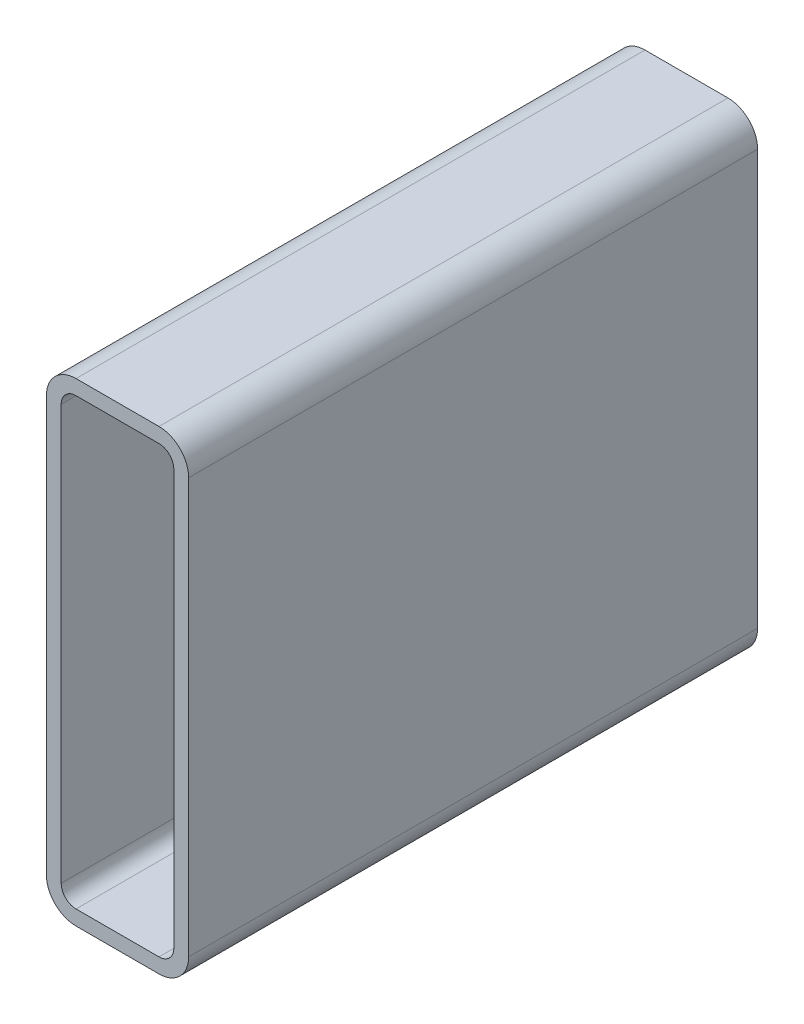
ISO-10303-21;
HEADER;
FILE_DESCRIPTION(('STEP AP214'),'2;1');
FILE_NAME('part.step','',(''),(''),'','','');
FILE_SCHEMA(('AUTOMOTIVE_DESIGN { 1 0 10303 214 1 1 1 1 }'));
ENDSEC;
DATA;
#1=APPLICATION_CONTEXT('core data for automotive mechanical design processes');
#2=APPLICATION_PROTOCOL_DEFINITION('international standard','automotive_design',2000,#1);
#3=PRODUCT_CONTEXT('',#1,'mechanical');
#4=PRODUCT('Part','Part','',(#3));
#5=PRODUCT_RELATED_PRODUCT_CATEGORY('part','',(#4));
#6=PRODUCT_DEFINITION_FORMATION('','',#4);
#7=PRODUCT_DEFINITION_CONTEXT('part definition',#1,'design');
#8=PRODUCT_DEFINITION('design','',#6,#7);
#9=PRODUCT_DEFINITION_SHAPE('','',#8);
#10=(LENGTH_UNIT() NAMED_UNIT(*) SI_UNIT(.MILLI.,.METRE.));
#11=(NAMED_UNIT(*) PLANE_ANGLE_UNIT() SI_UNIT($,.RADIAN.));
#12=(NAMED_UNIT(*) SI_UNIT($,.STERADIAN.) SOLID_ANGLE_UNIT());
#13=UNCERTAINTY_MEASURE_WITH_UNIT(LENGTH_MEASURE(1.E-05),#10,'distance_accuracy_value','');
#14=(GEOMETRIC_REPRESENTATION_CONTEXT(3) GLOBAL_UNCERTAINTY_ASSIGNED_CONTEXT((#13)) GLOBAL_UNIT_ASSIGNED_CONTEXT((#10,
#11,#12)) REPRESENTATION_CONTEXT('',''));
#15=CARTESIAN_POINT('',(0.,0.,0.));
#16=DIRECTION('',(0.,0.,1.));
#17=DIRECTION('',(1.,0.,0.));
#18=AXIS2_PLACEMENT_3D('',#15,#16,#17);
#19=CARTESIAN_POINT('',(18.3641160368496,240.045313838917,304.8));
#20=DIRECTION('',(0.,0.,1.));
#21=DIRECTION('',(1.,0.,0.));
#22=AXIS2_PLACEMENT_3D('',#19,#20,#21);
#23=PLANE('',#22);
#24=CARTESIAN_POINT('',(18.3641160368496,240.045313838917,304.8));
#25=DIRECTION('',(0.,0.,1.));
#26=DIRECTION('',(1.,0.,0.));
#27=AXIS2_PLACEMENT_3D('',#24,#25,#26);
#28=CIRCLE('',#27,15.875);
#29=CARTESIAN_POINT('',(18.3641160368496,255.920313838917,304.8));
#30=VERTEX_POINT('',#29);
#31=CARTESIAN_POINT('',(2.48911603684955,240.045313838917,304.8));
#32=VERTEX_POINT('',#31);
#33=EDGE_CURVE('E211',#30,#32,#28,.T.);
#34=ORIENTED_EDGE('',*,*,#33,.T.);
#35=DIRECTION('',(0.,-1.,0.));
#36=VECTOR('',#35,1.);
#37=CARTESIAN_POINT('',(2.48911603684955,17.7953138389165,304.8));
#38=LINE('',#37,#36);
#39=CARTESIAN_POINT('',(2.48911603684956,17.7953138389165,304.8));
#40=VERTEX_POINT('',#39);
#41=EDGE_CURVE('E214',#32,#40,#38,.T.);
#42=ORIENTED_EDGE('',*,*,#41,.T.);
#43=CARTESIAN_POINT('',(18.3641160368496,17.7953138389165,304.8));
#44=DIRECTION('',(0.,0.,1.));
#45=DIRECTION('',(1.,0.,0.));
#46=AXIS2_PLACEMENT_3D('',#43,#44,#45);
#47=CIRCLE('',#46,15.875);
#48=CARTESIAN_POINT('',(18.3641160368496,1.92031383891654,304.8));
#49=VERTEX_POINT('',#48);
#50=EDGE_CURVE('E217',#40,#49,#47,.T.);
#51=ORIENTED_EDGE('',*,*,#50,.T.);
#52=DIRECTION('',(1.,0.,0.));
#53=VECTOR('',#52,1.);
#54=CARTESIAN_POINT('',(62.8141160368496,1.92031383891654,304.8));
#55=LINE('',#54,#53);
#56=CARTESIAN_POINT('',(62.8141160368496,1.92031383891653,304.8));
#57=VERTEX_POINT('',#56);
#58=EDGE_CURVE('E219',#49,#57,#55,.T.);
#59=ORIENTED_EDGE('',*,*,#58,.T.);
#60=CARTESIAN_POINT('',(62.8141160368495,17.7953138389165,304.8));
#61=DIRECTION('',(0.,0.,1.));
#62=DIRECTION('',(1.,0.,0.));
#63=AXIS2_PLACEMENT_3D('',#60,#61,#62);
#64=CIRCLE('',#63,15.875);
#65=CARTESIAN_POINT('',(78.6891160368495,17.7953138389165,304.8));
#66=VERTEX_POINT('',#65);
#67=EDGE_CURVE('E221',#57,#66,#64,.T.);
#68=ORIENTED_EDGE('',*,*,#67,.T.);
#69=DIRECTION('',(0.,1.,0.));
#70=VECTOR('',#69,1.);
#71=CARTESIAN_POINT('',(78.6891160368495,240.045313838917,304.8));
#72=LINE('',#71,#70);
#73=CARTESIAN_POINT('',(78.6891160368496,240.045313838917,304.8));
#74=VERTEX_POINT('',#73);
#75=EDGE_CURVE('E223',#66,#74,#72,.T.);
#76=ORIENTED_EDGE('',*,*,#75,.T.);
#77=CARTESIAN_POINT('',(62.8141160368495,240.045313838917,304.8));
#78=DIRECTION('',(0.,0.,1.));
#79=DIRECTION('',(1.,0.,0.));
#80=AXIS2_PLACEMENT_3D('',#77,#78,#79);
#81=CIRCLE('',#80,15.875);
#82=CARTESIAN_POINT('',(62.8141160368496,255.920313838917,304.8));
#83=VERTEX_POINT('',#82);
#84=EDGE_CURVE('E225',#74,#83,#81,.T.);
#85=ORIENTED_EDGE('',*,*,#84,.T.);
#86=DIRECTION('',(-1.,0.,0.));
#87=VECTOR('',#86,1.);
#88=CARTESIAN_POINT('',(18.3641160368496,255.920313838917,304.8));
#89=LINE('',#88,#87);
#90=EDGE_CURVE('E227',#83,#30,#89,.T.);
#91=ORIENTED_EDGE('',*,*,#90,.T.);
#92=EDGE_LOOP('',(#34,#42,#51,#59,#68,#76,#85,#91));
#93=FACE_BOUND('',#92,.T.);
#94=DIRECTION('',(0.,-1.,0.));
#95=VECTOR('',#94,1.);
#96=CARTESIAN_POINT('',(10.4266160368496,17.7953138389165,304.8));
#97=LINE('',#96,#95);
#98=CARTESIAN_POINT('',(10.4266160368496,240.045313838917,304.8));
#99=VERTEX_POINT('',#98);
#100=CARTESIAN_POINT('',(10.4266160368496,17.7953138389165,304.8));
#101=VERTEX_POINT('',#100);
#102=EDGE_CURVE('E154',#99,#101,#97,.T.);
#103=ORIENTED_EDGE('',*,*,#102,.F.);
#104=CARTESIAN_POINT('',(18.3641160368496,240.045313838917,304.8));
#105=DIRECTION('',(0.,0.,1.));
#106=DIRECTION('',(1.,0.,0.));
#107=AXIS2_PLACEMENT_3D('',#104,#105,#106);
#108=CIRCLE('',#107,7.9375);
#109=CARTESIAN_POINT('',(18.3641160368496,247.982813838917,304.8));
#110=VERTEX_POINT('',#109);
#111=EDGE_CURVE('E146',#110,#99,#108,.T.);
#112=ORIENTED_EDGE('',*,*,#111,.F.);
#113=DIRECTION('',(-1.,0.,0.));
#114=VECTOR('',#113,1.);
#115=CARTESIAN_POINT('',(18.3641160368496,247.982813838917,304.8));
#116=LINE('',#115,#114);
#117=CARTESIAN_POINT('',(62.8141160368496,247.982813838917,304.8));
#118=VERTEX_POINT('',#117);
#119=EDGE_CURVE('E179',#118,#110,#116,.T.);
#120=ORIENTED_EDGE('',*,*,#119,.F.);
#121=CARTESIAN_POINT('',(62.8141160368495,240.045313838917,304.8));
#122=DIRECTION('',(0.,0.,1.));
#123=DIRECTION('',(1.,0.,0.));
#124=AXIS2_PLACEMENT_3D('',#121,#122,#123);
#125=CIRCLE('',#124,7.9375);
#126=CARTESIAN_POINT('',(70.7516160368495,240.045313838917,304.8));
#127=VERTEX_POINT('',#126);
#128=EDGE_CURVE('E177',#127,#118,#125,.T.);
#129=ORIENTED_EDGE('',*,*,#128,.F.);
#130=DIRECTION('',(0.,1.,0.));
#131=VECTOR('',#130,1.);
#132=CARTESIAN_POINT('',(70.7516160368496,240.045313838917,304.8));
#133=LINE('',#132,#131);
#134=CARTESIAN_POINT('',(70.7516160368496,17.7953138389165,304.8));
#135=VERTEX_POINT('',#134);
#136=EDGE_CURVE('E175',#135,#127,#133,.T.);
#137=ORIENTED_EDGE('',*,*,#136,.F.);
#138=CARTESIAN_POINT('',(62.8141160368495,17.7953138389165,304.8));
#139=DIRECTION('',(0.,0.,1.));
#140=DIRECTION('',(1.,0.,0.));
#141=AXIS2_PLACEMENT_3D('',#138,#139,#140);
#142=CIRCLE('',#141,7.93750000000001);
#143=CARTESIAN_POINT('',(62.8141160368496,9.85781383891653,304.8));
#144=VERTEX_POINT('',#143);
#145=EDGE_CURVE('E173',#144,#135,#142,.T.);
#146=ORIENTED_EDGE('',*,*,#145,.F.);
#147=DIRECTION('',(1.,0.,0.));
#148=VECTOR('',#147,1.);
#149=CARTESIAN_POINT('',(62.8141160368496,9.85781383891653,304.8));
#150=LINE('',#149,#148);
#151=CARTESIAN_POINT('',(18.3641160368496,9.85781383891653,304.8));
#152=VERTEX_POINT('',#151);
#153=EDGE_CURVE('E169',#152,#144,#150,.T.);
#154=ORIENTED_EDGE('',*,*,#153,.F.);
#155=CARTESIAN_POINT('',(18.3641160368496,17.7953138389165,304.8));
#156=DIRECTION('',(0.,0.,1.));
#157=DIRECTION('',(1.,0.,0.));
#158=AXIS2_PLACEMENT_3D('',#155,#156,#157);
#159=CIRCLE('',#158,7.9375);
#160=EDGE_CURVE('E167',#101,#152,#159,.T.);
#161=ORIENTED_EDGE('',*,*,#160,.F.);
#162=EDGE_LOOP('',(#103,#112,#120,#129,#137,#146,#154,#161));
#163=FACE_BOUND('',#162,.T.);
#164=ADVANCED_FACE('F33',(#93,#163),#23,.T.);
#165=CARTESIAN_POINT('',(18.3641160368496,240.045313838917,0.));
#166=DIRECTION('',(0.,0.,1.));
#167=DIRECTION('',(1.,0.,0.));
#168=AXIS2_PLACEMENT_3D('',#165,#166,#167);
#169=PLANE('',#168);
#170=CARTESIAN_POINT('',(18.3641160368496,240.045313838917,0.));
#171=DIRECTION('',(0.,0.,1.));
#172=DIRECTION('',(1.,0.,0.));
#173=AXIS2_PLACEMENT_3D('',#170,#171,#172);
#174=CIRCLE('',#173,15.875);
#175=CARTESIAN_POINT('',(18.3641160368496,255.920313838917,0.));
#176=VERTEX_POINT('',#175);
#177=CARTESIAN_POINT('',(2.48911603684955,240.045313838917,0.));
#178=VERTEX_POINT('',#177);
#179=EDGE_CURVE('E162',#176,#178,#174,.T.);
#180=ORIENTED_EDGE('',*,*,#179,.F.);
#181=DIRECTION('',(-1.,0.,0.));
#182=VECTOR('',#181,1.);
#183=CARTESIAN_POINT('',(18.3641160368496,255.920313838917,0.));
#184=LINE('',#183,#182);
#185=CARTESIAN_POINT('',(62.8141160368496,255.920313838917,0.));
#186=VERTEX_POINT('',#185);
#187=EDGE_CURVE('E215',#186,#176,#184,.T.);
#188=ORIENTED_EDGE('',*,*,#187,.F.);
#189=CARTESIAN_POINT('',(62.8141160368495,240.045313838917,0.));
#190=DIRECTION('',(0.,0.,1.));
#191=DIRECTION('',(1.,0.,0.));
#192=AXIS2_PLACEMENT_3D('',#189,#190,#191);
#193=CIRCLE('',#192,15.875);
#194=CARTESIAN_POINT('',(78.6891160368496,240.045313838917,0.));
#195=VERTEX_POINT('',#194);
#196=EDGE_CURVE('E242',#195,#186,#193,.T.);
#197=ORIENTED_EDGE('',*,*,#196,.F.);
#198=DIRECTION('',(0.,1.,0.));
#199=VECTOR('',#198,1.);
#200=CARTESIAN_POINT('',(78.6891160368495,240.045313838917,0.));
#201=LINE('',#200,#199);
#202=CARTESIAN_POINT('',(78.6891160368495,17.7953138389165,0.));
#203=VERTEX_POINT('',#202);
#204=EDGE_CURVE('E240',#203,#195,#201,.T.);
#205=ORIENTED_EDGE('',*,*,#204,.F.);
#206=CARTESIAN_POINT('',(62.8141160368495,17.7953138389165,0.));
#207=DIRECTION('',(0.,0.,1.));
#208=DIRECTION('',(1.,0.,0.));
#209=AXIS2_PLACEMENT_3D('',#206,#207,#208);
#210=CIRCLE('',#209,15.875);
#211=CARTESIAN_POINT('',(62.8141160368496,1.92031383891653,0.));
#212=VERTEX_POINT('',#211);
#213=EDGE_CURVE('E238',#212,#203,#210,.T.);
#214=ORIENTED_EDGE('',*,*,#213,.F.);
#215=DIRECTION('',(1.,0.,0.));
#216=VECTOR('',#215,1.);
#217=CARTESIAN_POINT('',(62.8141160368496,1.92031383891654,0.));
#218=LINE('',#217,#216);
#219=CARTESIAN_POINT('',(18.3641160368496,1.92031383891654,0.));
#220=VERTEX_POINT('',#219);
#221=EDGE_CURVE('E236',#220,#212,#218,.T.);
#222=ORIENTED_EDGE('',*,*,#221,.F.);
#223=CARTESIAN_POINT('',(18.3641160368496,17.7953138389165,0.));
#224=DIRECTION('',(0.,0.,1.));
#225=DIRECTION('',(1.,0.,0.));
#226=AXIS2_PLACEMENT_3D('',#223,#224,#225);
#227=CIRCLE('',#226,15.875);
#228=CARTESIAN_POINT('',(2.48911603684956,17.7953138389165,0.));
#229=VERTEX_POINT('',#228);
#230=EDGE_CURVE('E234',#229,#220,#227,.T.);
#231=ORIENTED_EDGE('',*,*,#230,.F.);
#232=DIRECTION('',(0.,-1.,0.));
#233=VECTOR('',#232,1.);
#234=CARTESIAN_POINT('',(2.48911603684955,17.7953138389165,0.));
#235=LINE('',#234,#233);
#236=EDGE_CURVE('E232',#178,#229,#235,.T.);
#237=ORIENTED_EDGE('',*,*,#236,.F.);
#238=EDGE_LOOP('',(#180,#188,#197,#205,#214,#222,#231,#237));
#239=FACE_BOUND('',#238,.T.);
#240=CARTESIAN_POINT('',(18.3641160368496,240.045313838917,0.));
#241=DIRECTION('',(0.,0.,1.));
#242=DIRECTION('',(1.,0.,0.));
#243=AXIS2_PLACEMENT_3D('',#240,#241,#242);
#244=CIRCLE('',#243,7.9375);
#245=CARTESIAN_POINT('',(18.3641160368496,247.982813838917,0.));
#246=VERTEX_POINT('',#245);
#247=CARTESIAN_POINT('',(10.4266160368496,240.045313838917,0.));
#248=VERTEX_POINT('',#247);
#249=EDGE_CURVE('E56',#246,#248,#244,.T.);
#250=ORIENTED_EDGE('',*,*,#249,.T.);
#251=DIRECTION('',(0.,-1.,0.));
#252=VECTOR('',#251,1.);
#253=CARTESIAN_POINT('',(10.4266160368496,17.7953138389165,0.));
#254=LINE('',#253,#252);
#255=CARTESIAN_POINT('',(10.4266160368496,17.7953138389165,0.));
#256=VERTEX_POINT('',#255);
#257=EDGE_CURVE('E161',#248,#256,#254,.T.);
#258=ORIENTED_EDGE('',*,*,#257,.T.);
#259=CARTESIAN_POINT('',(18.3641160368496,17.7953138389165,0.));
#260=DIRECTION('',(0.,0.,1.));
#261=DIRECTION('',(1.,0.,0.));
#262=AXIS2_PLACEMENT_3D('',#259,#260,#261);
#263=CIRCLE('',#262,7.9375);
#264=CARTESIAN_POINT('',(18.3641160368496,9.85781383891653,0.));
#265=VERTEX_POINT('',#264);
#266=EDGE_CURVE('E183',#256,#265,#263,.T.);
#267=ORIENTED_EDGE('',*,*,#266,.T.);
#268=DIRECTION('',(1.,0.,0.));
#269=VECTOR('',#268,1.);
#270=CARTESIAN_POINT('',(62.8141160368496,9.85781383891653,0.));
#271=LINE('',#270,#269);
#272=CARTESIAN_POINT('',(62.8141160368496,9.85781383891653,0.));
#273=VERTEX_POINT('',#272);
#274=EDGE_CURVE('E186',#265,#273,#271,.T.);
#275=ORIENTED_EDGE('',*,*,#274,.T.);
#276=CARTESIAN_POINT('',(62.8141160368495,17.7953138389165,0.));
#277=DIRECTION('',(0.,0.,1.));
#278=DIRECTION('',(1.,0.,0.));
#279=AXIS2_PLACEMENT_3D('',#276,#277,#278);
#280=CIRCLE('',#279,7.93750000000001);
#281=CARTESIAN_POINT('',(70.7516160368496,17.7953138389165,0.));
#282=VERTEX_POINT('',#281);
#283=EDGE_CURVE('E189',#273,#282,#280,.T.);
#284=ORIENTED_EDGE('',*,*,#283,.T.);
#285=DIRECTION('',(0.,1.,0.));
#286=VECTOR('',#285,1.);
#287=CARTESIAN_POINT('',(70.7516160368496,240.045313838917,0.));
#288=LINE('',#287,#286);
#289=CARTESIAN_POINT('',(70.7516160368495,240.045313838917,0.));
#290=VERTEX_POINT('',#289);
#291=EDGE_CURVE('E192',#282,#290,#288,.T.);
#292=ORIENTED_EDGE('',*,*,#291,.T.);
#293=CARTESIAN_POINT('',(62.8141160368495,240.045313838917,0.));
#294=DIRECTION('',(0.,0.,1.));
#295=DIRECTION('',(1.,0.,0.));
#296=AXIS2_PLACEMENT_3D('',#293,#294,#295);
#297=CIRCLE('',#296,7.9375);
#298=CARTESIAN_POINT('',(62.8141160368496,247.982813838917,0.));
#299=VERTEX_POINT('',#298);
#300=EDGE_CURVE('E195',#290,#299,#297,.T.);
#301=ORIENTED_EDGE('',*,*,#300,.T.);
#302=DIRECTION('',(-1.,0.,0.));
#303=VECTOR('',#302,1.);
#304=CARTESIAN_POINT('',(18.3641160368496,247.982813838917,0.));
#305=LINE('',#304,#303);
#306=EDGE_CURVE('E155',#299,#246,#305,.T.);
#307=ORIENTED_EDGE('',*,*,#306,.T.);
#308=EDGE_LOOP('',(#250,#258,#267,#275,#284,#292,#301,#307));
#309=FACE_BOUND('',#308,.T.);
#310=ADVANCED_FACE('F272',(#239,#309),#169,.F.);
#311=CARTESIAN_POINT('',(18.3641160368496,240.045313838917,304.8));
#312=DIRECTION('',(0.,0.,-1.));
#313=DIRECTION('',(-1.,0.,0.));
#314=AXIS2_PLACEMENT_3D('',#311,#312,#313);
#315=CYLINDRICAL_SURFACE('',#314,15.875);
#316=ORIENTED_EDGE('',*,*,#179,.T.);
#317=DIRECTION('',(0.,0.,-1.));
#318=VECTOR('',#317,1.);
#319=CARTESIAN_POINT('',(2.48911603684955,240.045313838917,304.8));
#320=LINE('',#319,#318);
#321=EDGE_CURVE('E11',#32,#178,#320,.T.);
#322=ORIENTED_EDGE('',*,*,#321,.F.);
#323=ORIENTED_EDGE('',*,*,#33,.F.);
#324=DIRECTION('',(0.,0.,-1.));
#325=VECTOR('',#324,1.);
#326=CARTESIAN_POINT('',(18.3641160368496,255.920313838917,304.8));
#327=LINE('',#326,#325);
#328=EDGE_CURVE('E229',#30,#176,#327,.T.);
#329=ORIENTED_EDGE('',*,*,#328,.T.);
#330=EDGE_LOOP('',(#316,#322,#323,#329));
#331=FACE_BOUND('',#330,.T.);
#332=ADVANCED_FACE('F35',(#331),#315,.T.);
#333=CARTESIAN_POINT('',(2.48911603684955,17.7953138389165,304.8));
#334=DIRECTION('',(1.,0.,0.));
#335=DIRECTION('',(0.,0.,-1.));
#336=AXIS2_PLACEMENT_3D('',#333,#334,#335);
#337=PLANE('',#336);
#338=ORIENTED_EDGE('',*,*,#236,.T.);
#339=DIRECTION('',(0.,0.,-1.));
#340=VECTOR('',#339,1.);
#341=CARTESIAN_POINT('',(2.48911603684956,17.7953138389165,304.8));
#342=LINE('',#341,#340);
#343=EDGE_CURVE('E41',#40,#229,#342,.T.);
#344=ORIENTED_EDGE('',*,*,#343,.F.);
#345=ORIENTED_EDGE('',*,*,#41,.F.);
#346=ORIENTED_EDGE('',*,*,#321,.T.);
#347=EDGE_LOOP('',(#338,#344,#345,#346));
#348=FACE_BOUND('',#347,.T.);
#349=ADVANCED_FACE('F289',(#348),#337,.F.);
#350=CARTESIAN_POINT('',(18.3641160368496,17.7953138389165,304.8));
#351=DIRECTION('',(0.,0.,-1.));
#352=DIRECTION('',(-1.,0.,0.));
#353=AXIS2_PLACEMENT_3D('',#350,#351,#352);
#354=CYLINDRICAL_SURFACE('',#353,15.875);
#355=ORIENTED_EDGE('',*,*,#230,.T.);
#356=DIRECTION('',(0.,0.,-1.));
#357=VECTOR('',#356,1.);
#358=CARTESIAN_POINT('',(18.3641160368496,1.92031383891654,304.8));
#359=LINE('',#358,#357);
#360=EDGE_CURVE('E259',#49,#220,#359,.T.);
#361=ORIENTED_EDGE('',*,*,#360,.F.);
#362=ORIENTED_EDGE('',*,*,#50,.F.);
#363=ORIENTED_EDGE('',*,*,#343,.T.);
#364=EDGE_LOOP('',(#355,#361,#362,#363));
#365=FACE_BOUND('',#364,.T.);
#366=ADVANCED_FACE('F266',(#365),#354,.T.);
#367=CARTESIAN_POINT('',(62.8141160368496,1.92031383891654,304.8));
#368=DIRECTION('',(0.,1.,0.));
#369=DIRECTION('',(0.,0.,1.));
#370=AXIS2_PLACEMENT_3D('',#367,#368,#369);
#371=PLANE('',#370);
#372=ORIENTED_EDGE('',*,*,#221,.T.);
#373=DIRECTION('',(0.,0.,-1.));
#374=VECTOR('',#373,1.);
#375=CARTESIAN_POINT('',(62.8141160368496,1.92031383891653,304.8));
#376=LINE('',#375,#374);
#377=EDGE_CURVE('E256',#57,#212,#376,.T.);
#378=ORIENTED_EDGE('',*,*,#377,.F.);
#379=ORIENTED_EDGE('',*,*,#58,.F.);
#380=ORIENTED_EDGE('',*,*,#360,.T.);
#381=EDGE_LOOP('',(#372,#378,#379,#380));
#382=FACE_BOUND('',#381,.T.);
#383=ADVANCED_FACE('F278',(#382),#371,.F.);
#384=CARTESIAN_POINT('',(62.8141160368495,17.7953138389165,304.8));
#385=DIRECTION('',(0.,0.,-1.));
#386=DIRECTION('',(-1.,0.,0.));
#387=AXIS2_PLACEMENT_3D('',#384,#385,#386);
#388=CYLINDRICAL_SURFACE('',#387,15.875);
#389=ORIENTED_EDGE('',*,*,#213,.T.);
#390=DIRECTION('',(0.,0.,-1.));
#391=VECTOR('',#390,1.);
#392=CARTESIAN_POINT('',(78.6891160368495,17.7953138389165,304.8));
#393=LINE('',#392,#391);
#394=EDGE_CURVE('E253',#66,#203,#393,.T.);
#395=ORIENTED_EDGE('',*,*,#394,.F.);
#396=ORIENTED_EDGE('',*,*,#67,.F.);
#397=ORIENTED_EDGE('',*,*,#377,.T.);
#398=EDGE_LOOP('',(#389,#395,#396,#397));
#399=FACE_BOUND('',#398,.T.);
#400=ADVANCED_FACE('F282',(#399),#388,.T.);
#401=CARTESIAN_POINT('',(78.6891160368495,240.045313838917,304.8));
#402=DIRECTION('',(-1.,0.,0.));
#403=DIRECTION('',(0.,0.,1.));
#404=AXIS2_PLACEMENT_3D('',#401,#402,#403);
#405=PLANE('',#404);
#406=ORIENTED_EDGE('',*,*,#204,.T.);
#407=DIRECTION('',(0.,0.,-1.));
#408=VECTOR('',#407,1.);
#409=CARTESIAN_POINT('',(78.6891160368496,240.045313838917,304.8));
#410=LINE('',#409,#408);
#411=EDGE_CURVE('E250',#74,#195,#410,.T.);
#412=ORIENTED_EDGE('',*,*,#411,.F.);
#413=ORIENTED_EDGE('',*,*,#75,.F.);
#414=ORIENTED_EDGE('',*,*,#394,.T.);
#415=EDGE_LOOP('',(#406,#412,#413,#414));
#416=FACE_BOUND('',#415,.T.);
#417=ADVANCED_FACE('F302',(#416),#405,.F.);
#418=CARTESIAN_POINT('',(62.8141160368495,240.045313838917,304.8));
#419=DIRECTION('',(0.,0.,-1.));
#420=DIRECTION('',(-1.,0.,0.));
#421=AXIS2_PLACEMENT_3D('',#418,#419,#420);
#422=CYLINDRICAL_SURFACE('',#421,15.875);
#423=ORIENTED_EDGE('',*,*,#196,.T.);
#424=DIRECTION('',(0.,0.,-1.));
#425=VECTOR('',#424,1.);
#426=CARTESIAN_POINT('',(62.8141160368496,255.920313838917,304.8));
#427=LINE('',#426,#425);
#428=EDGE_CURVE('E247',#83,#186,#427,.T.);
#429=ORIENTED_EDGE('',*,*,#428,.F.);
#430=ORIENTED_EDGE('',*,*,#84,.F.);
#431=ORIENTED_EDGE('',*,*,#411,.T.);
#432=EDGE_LOOP('',(#423,#429,#430,#431));
#433=FACE_BOUND('',#432,.T.);
#434=ADVANCED_FACE('F300',(#433),#422,.T.);
#435=CARTESIAN_POINT('',(18.3641160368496,255.920313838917,304.8));
#436=DIRECTION('',(0.,-1.,0.));
#437=DIRECTION('',(0.,0.,-1.));
#438=AXIS2_PLACEMENT_3D('',#435,#436,#437);
#439=PLANE('',#438);
#440=ORIENTED_EDGE('',*,*,#187,.T.);
#441=ORIENTED_EDGE('',*,*,#328,.F.);
#442=ORIENTED_EDGE('',*,*,#90,.F.);
#443=ORIENTED_EDGE('',*,*,#428,.T.);
#444=EDGE_LOOP('',(#440,#441,#442,#443));
#445=FACE_BOUND('',#444,.T.);
#446=ADVANCED_FACE('F295',(#445),#439,.F.);
#447=CARTESIAN_POINT('',(18.3641160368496,240.045313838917,304.8));
#448=DIRECTION('',(0.,0.,-1.));
#449=DIRECTION('',(-1.,0.,0.));
#450=AXIS2_PLACEMENT_3D('',#447,#448,#449);
#451=CYLINDRICAL_SURFACE('',#450,7.9375);
#452=ORIENTED_EDGE('',*,*,#249,.F.);
#453=DIRECTION('',(0.,0.,-1.));
#454=VECTOR('',#453,1.);
#455=CARTESIAN_POINT('',(18.3641160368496,247.982813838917,304.8));
#456=LINE('',#455,#454);
#457=EDGE_CURVE('E150',#110,#246,#456,.T.);
#458=ORIENTED_EDGE('',*,*,#457,.F.);
#459=ORIENTED_EDGE('',*,*,#111,.T.);
#460=DIRECTION('',(0.,0.,-1.));
#461=VECTOR('',#460,1.);
#462=CARTESIAN_POINT('',(10.4266160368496,240.045313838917,304.8));
#463=LINE('',#462,#461);
#464=EDGE_CURVE('E149',#99,#248,#463,.T.);
#465=ORIENTED_EDGE('',*,*,#464,.T.);
#466=EDGE_LOOP('',(#452,#458,#459,#465));
#467=FACE_BOUND('',#466,.T.);
#468=ADVANCED_FACE('F148',(#467),#451,.F.);
#469=CARTESIAN_POINT('',(10.4266160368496,17.7953138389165,304.8));
#470=DIRECTION('',(1.,0.,0.));
#471=DIRECTION('',(0.,0.,-1.));
#472=AXIS2_PLACEMENT_3D('',#469,#470,#471);
#473=PLANE('',#472);
#474=ORIENTED_EDGE('',*,*,#257,.F.);
#475=ORIENTED_EDGE('',*,*,#464,.F.);
#476=ORIENTED_EDGE('',*,*,#102,.T.);
#477=DIRECTION('',(0.,0.,-1.));
#478=VECTOR('',#477,1.);
#479=CARTESIAN_POINT('',(10.4266160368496,17.7953138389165,304.8));
#480=LINE('',#479,#478);
#481=EDGE_CURVE('E163',#101,#256,#480,.T.);
#482=ORIENTED_EDGE('',*,*,#481,.T.);
#483=EDGE_LOOP('',(#474,#475,#476,#482));
#484=FACE_BOUND('',#483,.T.);
#485=ADVANCED_FACE('F158',(#484),#473,.T.);
#486=CARTESIAN_POINT('',(18.3641160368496,17.7953138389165,304.8));
#487=DIRECTION('',(0.,0.,-1.));
#488=DIRECTION('',(-1.,0.,0.));
#489=AXIS2_PLACEMENT_3D('',#486,#487,#488);
#490=CYLINDRICAL_SURFACE('',#489,7.9375);
#491=ORIENTED_EDGE('',*,*,#266,.F.);
#492=ORIENTED_EDGE('',*,*,#481,.F.);
#493=ORIENTED_EDGE('',*,*,#160,.T.);
#494=DIRECTION('',(0.,0.,-1.));
#495=VECTOR('',#494,1.);
#496=CARTESIAN_POINT('',(18.3641160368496,9.85781383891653,304.8));
#497=LINE('',#496,#495);
#498=EDGE_CURVE('E208',#152,#265,#497,.T.);
#499=ORIENTED_EDGE('',*,*,#498,.T.);
#500=EDGE_LOOP('',(#491,#492,#493,#499));
#501=FACE_BOUND('',#500,.T.);
#502=ADVANCED_FACE('F327',(#501),#490,.F.);
#503=CARTESIAN_POINT('',(62.8141160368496,9.85781383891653,304.8));
#504=DIRECTION('',(0.,1.,0.));
#505=DIRECTION('',(0.,0.,1.));
#506=AXIS2_PLACEMENT_3D('',#503,#504,#505);
#507=PLANE('',#506);
#508=ORIENTED_EDGE('',*,*,#274,.F.);
#509=ORIENTED_EDGE('',*,*,#498,.F.);
#510=ORIENTED_EDGE('',*,*,#153,.T.);
#511=DIRECTION('',(0.,0.,-1.));
#512=VECTOR('',#511,1.);
#513=CARTESIAN_POINT('',(62.8141160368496,9.85781383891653,304.8));
#514=LINE('',#513,#512);
#515=EDGE_CURVE('E206',#144,#273,#514,.T.);
#516=ORIENTED_EDGE('',*,*,#515,.T.);
#517=EDGE_LOOP('',(#508,#509,#510,#516));
#518=FACE_BOUND('',#517,.T.);
#519=ADVANCED_FACE('F331',(#518),#507,.T.);
#520=CARTESIAN_POINT('',(62.8141160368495,17.7953138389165,304.8));
#521=DIRECTION('',(0.,0.,-1.));
#522=DIRECTION('',(-1.,0.,0.));
#523=AXIS2_PLACEMENT_3D('',#520,#521,#522);
#524=CYLINDRICAL_SURFACE('',#523,7.93750000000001);
#525=ORIENTED_EDGE('',*,*,#283,.F.);
#526=ORIENTED_EDGE('',*,*,#515,.F.);
#527=ORIENTED_EDGE('',*,*,#145,.T.);
#528=DIRECTION('',(0.,0.,-1.));
#529=VECTOR('',#528,1.);
#530=CARTESIAN_POINT('',(70.7516160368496,17.7953138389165,304.8));
#531=LINE('',#530,#529);
#532=EDGE_CURVE('E204',#135,#282,#531,.T.);
#533=ORIENTED_EDGE('',*,*,#532,.T.);
#534=EDGE_LOOP('',(#525,#526,#527,#533));
#535=FACE_BOUND('',#534,.T.);
#536=ADVANCED_FACE('F337',(#535),#524,.F.);
#537=CARTESIAN_POINT('',(70.7516160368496,240.045313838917,304.8));
#538=DIRECTION('',(-1.,0.,0.));
#539=DIRECTION('',(0.,0.,1.));
#540=AXIS2_PLACEMENT_3D('',#537,#538,#539);
#541=PLANE('',#540);
#542=ORIENTED_EDGE('',*,*,#291,.F.);
#543=ORIENTED_EDGE('',*,*,#532,.F.);
#544=ORIENTED_EDGE('',*,*,#136,.T.);
#545=DIRECTION('',(0.,0.,-1.));
#546=VECTOR('',#545,1.);
#547=CARTESIAN_POINT('',(70.7516160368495,240.045313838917,304.8));
#548=LINE('',#547,#546);
#549=EDGE_CURVE('E202',#127,#290,#548,.T.);
#550=ORIENTED_EDGE('',*,*,#549,.T.);
#551=EDGE_LOOP('',(#542,#543,#544,#550));
#552=FACE_BOUND('',#551,.T.);
#553=ADVANCED_FACE('F341',(#552),#541,.T.);
#554=CARTESIAN_POINT('',(62.8141160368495,240.045313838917,304.8));
#555=DIRECTION('',(0.,0.,-1.));
#556=DIRECTION('',(-1.,0.,0.));
#557=AXIS2_PLACEMENT_3D('',#554,#555,#556);
#558=CYLINDRICAL_SURFACE('',#557,7.9375);
#559=ORIENTED_EDGE('',*,*,#300,.F.);
#560=ORIENTED_EDGE('',*,*,#549,.F.);
#561=ORIENTED_EDGE('',*,*,#128,.T.);
#562=DIRECTION('',(0.,0.,-1.));
#563=VECTOR('',#562,1.);
#564=CARTESIAN_POINT('',(62.8141160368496,247.982813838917,304.8));
#565=LINE('',#564,#563);
#566=EDGE_CURVE('E48',#118,#299,#565,.T.);
#567=ORIENTED_EDGE('',*,*,#566,.T.);
#568=EDGE_LOOP('',(#559,#560,#561,#567));
#569=FACE_BOUND('',#568,.T.);
#570=ADVANCED_FACE('F345',(#569),#558,.F.);
#571=CARTESIAN_POINT('',(18.3641160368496,247.982813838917,304.8));
#572=DIRECTION('',(0.,-1.,0.));
#573=DIRECTION('',(0.,0.,-1.));
#574=AXIS2_PLACEMENT_3D('',#571,#572,#573);
#575=PLANE('',#574);
#576=ORIENTED_EDGE('',*,*,#306,.F.);
#577=ORIENTED_EDGE('',*,*,#566,.F.);
#578=ORIENTED_EDGE('',*,*,#119,.T.);
#579=ORIENTED_EDGE('',*,*,#457,.T.);
#580=EDGE_LOOP('',(#576,#577,#578,#579));
#581=FACE_BOUND('',#580,.T.);
#582=ADVANCED_FACE('F349',(#581),#575,.T.);
#583=CLOSED_SHELL('',(#164,#310,#332,#349,#366,#383,#400,#417,#434,#446,#468,#485,#502,#519,
#536,#553,#570,#582));
#584=MANIFOLD_SOLID_BREP('B2',#583);
#585=ADVANCED_BREP_SHAPE_REPRESENTATION('',(#18,#584),#14);
#586=SHAPE_DEFINITION_REPRESENTATION(#9,#585);
ENDSEC;
END-ISO-10303-21;
